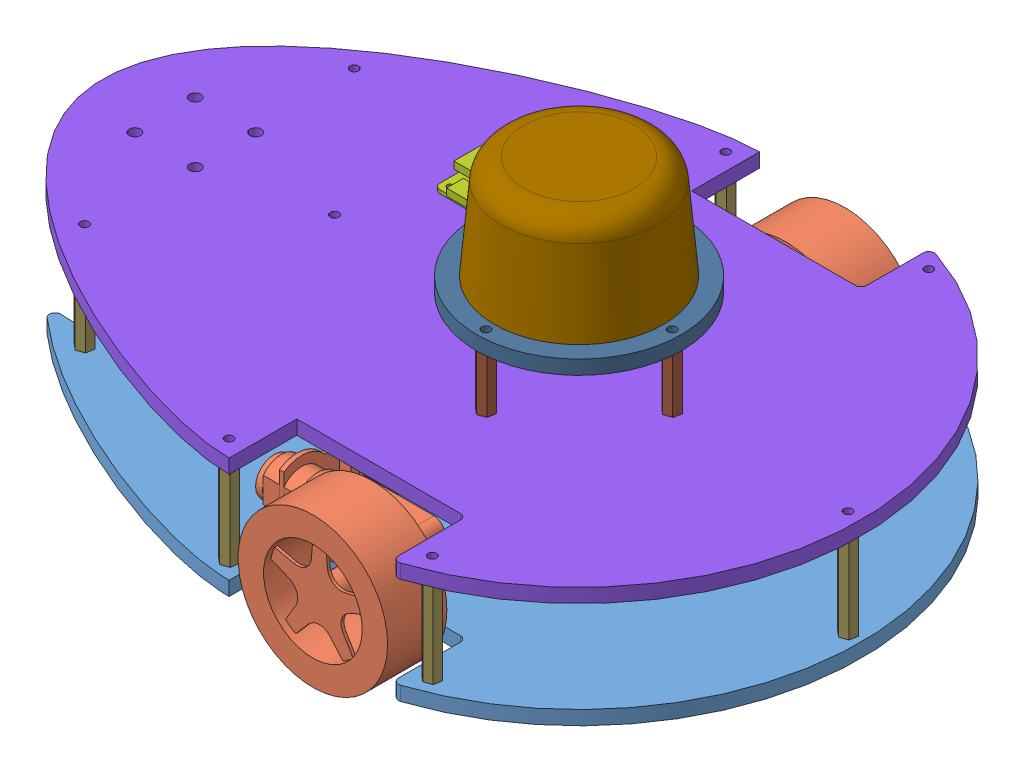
SolidWorks assembly robot assembly.SLDASM, configuration Default (file format 9000). Lengths in mm.
Overall size (416.56 149.8 241.6).
27 component instances, 13 part files, 49 mates.
Components (placement in the parent):
- lower chassis plate-1: lower chassis plate.SLDPRT [Default] at (73.1533 135.0562 185.2311) size (310.56 6.35 241.22)
- wheel and drive motor-1: wheel and drive motor.SLDPRT [Default] at (148.6894 152.5187 81.7252) x (0 0 -1) z (1 0 0) size (66.17 67.31 91.19)
- wheel and drive motor-2: wheel and drive motor.SLDPRT [Default] at (148.6894 152.5187 267.9072) x (0 0 1) z (1 0 0) size (66.17 67.31 91.19)
- caster wheel assembly-1: caster wheel assembly.SLDASM [Default] at (-34.1713 154.1876 146.7555) size (68.07 65.34 46.76)
  - caster wheel metal-1: caster wheel metal.SLDPRT [Default] at (10.1406 20.1116 28.0607) size (37.85 8.38 37.85)
  - caster wheel black-1: caster wheel black.SLDPRT [Default] at (27.9636 -12.2099 47.9757) x (0 -1 0) z (0.047283 0 -0.998882) size (38.35 59.06 38.73)
  - caster wheel wheelet-1: caster wheel wheelet.SLDPRT [Default] at (29.2727 -12.2099 20.3206) x (0.047283 0 -0.998882) z (0.998882 0 0.047283) size (13.61 49.28 49.28)
  - caster wheel wheelet-2: caster wheel wheelet.SLDPRT [Default] at (28.456 -12.2099 37.5733) x (-0.047283 0 0.998882) z (-0.998882 0 -0.047283) size (13.61 49.28 49.28)
- L298 motor controller-1: L298 motor controller.SLDPRT [Default] at (35.5823 141.4062 103.272) x (0 0 1) z (-1 0 0) size (44.2 26.54 44.2)
- raspberry pi zero w-1: raspberry pi zero w.SLDPRT [Default] at (52.4313 189.0312 143.7038) size (67.31 4.76 31.24)
- upper chassis plate2-1: upper chassis plate2.SLDPRT [Default] at (73.1533 182.6812 185.2311) size (416.56 6.35 241.22)
- rplidar-1: rplidar.SLDPRT [Default] at (149.9594 220.7812 176.0452) x (0.988399 0 0.15188) z (-0.15188 0 0.988399) size (76.2 46.35 76.2)
- rplidar mount-1: rplidar mount.SLDPRT [Default] at (149.9594 214.4312 176.0452) size (92.08 6.35 92.08)
- mcmaster 91115a133 6-32 standoff-1: mcmaster 91115a133 6-32 standoff.SLDPRT [Default] at (149.9594 214.4312 134.1352) x (1 0 0) z (0 -1 0) size (6.89 7.22 25.4)
- mcmaster 91115a133 6-32 standoff-2: mcmaster 91115a133 6-32 standoff.SLDPRT [Default] at (191.8694 214.4312 176.0452) x (0.999015 0 0.044379) z (0 -1 0) size (6.89 7.22 25.4)
- mcmaster 91115a133 6-32 standoff-3: mcmaster 91115a133 6-32 standoff.SLDPRT [Default] at (108.0494 214.4312 176.0452) x (1 0 0) z (0 -1 0) size (6.89 7.22 25.4)
- mcmaster 91115a133 6-32 standoff-4: mcmaster 91115a133 6-32 standoff.SLDPRT [Default] at (149.9594 214.4312 217.9552) x (1 0 0) z (0 -1 0) size (6.89 7.22 25.4)
- mcmaster 91115a564 6-32 standoff-1: mcmaster 91115a564 6-32 standoff.SLDPRT [Default] at (-13.1386 182.6812 114.1102) x (1 0 0) z (0 -1 0) size (6.89 7.22 41.27)
- mcmaster 91115a564 6-32 standoff-2: mcmaster 91115a564 6-32 standoff.SLDPRT [Default] at (-13.1386 182.6812 235.5222) x (1 0 0) z (0 -1 0) size (6.89 7.22 41.27)
- mcmaster 91115a564 6-32 standoff-3: mcmaster 91115a564 6-32 standoff.SLDPRT [Default] at (39.4694 182.6812 175.5782) x (1 0 0) z (0 -1 0) size (6.89 7.22 41.27)
- mcmaster 91115a564 6-32 standoff-4: mcmaster 91115a564 6-32 standoff.SLDPRT [Default] at (102.9694 182.6812 63.0562) x (1 0 0) z (0 -1 0) size (6.89 7.22 41.27)
- mcmaster 91115a564 6-32 standoff-5: mcmaster 91115a564 6-32 standoff.SLDPRT [Default] at (102.9694 182.6812 286.5762) x (1 0 0) z (0 -1 0) size (6.89 7.22 41.27)
- mcmaster 91115a564 6-32 standoff-6: mcmaster 91115a564 6-32 standoff.SLDPRT [Default] at (194.4094 182.6812 286.5762) x (1 0 0) z (0 -1 0) size (6.89 7.22 41.27)
- mcmaster 91115a564 6-32 standoff-7: mcmaster 91115a564 6-32 standoff.SLDPRT [Default] at (270.6094 182.6812 175.5782) x (1 0 0) z (0 -1 0) size (6.89 7.22 41.27)
- mcmaster 91115a564 6-32 standoff-8: mcmaster 91115a564 6-32 standoff.SLDPRT [Default] at (194.4094 182.6812 63.0562) x (1 0 0) z (0 -1 0) size (6.89 7.22 41.27)
- motor mount-1: motor mount.SLDPRT [Default] at (133.0684 164.0122 109.0302) x (-1 0 0) z (0 0 1) size (12.7 22.86 4.57)
- motor mount-2: motor mount.SLDPRT [Default] at (133.0684 164.0122 245.1742) x (-1 0 0) z (0 0 1) size (12.7 22.86 4.57)
Mates (geometry in assembly coordinates):
- Coincident2: coincident anti-aligned: plane of lower chassis plate-1 through (-65.6231 141.4062 174.8162) normal (0 1 0); plane of wheel and drive motor-1 through (153.7694 141.4062 104.4582) normal (0 -1 0)
- Coincident3: coincident aligned: plane of lower chassis plate-1 through (110.5894 141.4062 263.7162) normal (0 0 1); plane of wheel and drive motor-2 through (153.7694 158.5512 263.7162) normal (0 0 1)
- Coincident5: coincident anti-aligned: plane of lower chassis plate-1 through (-65.6231 141.4062 174.8162) normal (0 1 0); plane of wheel and drive motor-2 through (153.7694 141.4062 245.1742) normal (0 -1 0)
- Coincident11: coincident anti-aligned: plane of lower chassis plate-1 through (-65.6231 141.4062 174.8162) normal (0 1 0); plane of L298 motor controller-1 through (35.5823 141.4062 103.272) normal (0 -1 0)
- Distance2: distance = 27.94 mm anti-aligned: plane of wheel and drive motor-1 through (158.8494 158.5512 104.4582) normal (1 0 0); plane of lower chassis plate-1 through (186.7894 141.4062 57.9762) normal (-1 0 0)
- Distance3: distance = 27.94 mm anti-aligned: plane of wheel and drive motor-2 through (158.8494 146.4862 245.1742) normal (1 0 0); plane of lower chassis plate-1 through (186.7894 141.4062 266.2562) normal (-1 0 0)
- Coincident16: coincident aligned: plane of lower chassis plate-1 through (110.5894 141.4062 85.9162) normal (0 0 -1); plane of wheel and drive motor-1 through (153.7694 146.4862 85.9162) normal (0 0 -1)
- Coincident25: coincident aligned: plane of lower chassis plate-1 through (110.5894 141.4062 263.7162) normal (0 0 1); plane of upper chassis plate2-1 through (110.5894 189.0312 263.7162) normal (0 0 1)
- Coincident26: coincident aligned: plane of lower chassis plate-1 through (186.7894 141.4062 266.2562) normal (-1 0 0); plane of upper chassis plate2-1 through (186.7894 189.0312 266.2562) normal (-1 0 0)
- Concentric5: concentric anti-aligned: cylinder of upper chassis plate2-1 through (149.9594 189.0312 176.0452) axis (0 -1 0) radius 127; circle of rplidar-1
- Coincident29: coincident anti-aligned: plane of rplidar-1 through (149.9594 220.7812 176.0452) normal (0 -1 0); plane of rplidar mount-1 through (149.9594 220.7812 176.0452) normal (0 1 0)
- Concentric6: concentric anti-aligned: circle of rplidar-1; cylinder of rplidar mount-1 through (149.9594 220.7812 176.0452) axis (0 -1 0) radius 46.0375
- Coincident31: coincident anti-aligned: plane of raspberry pi zero w-1 through (54.9713 189.0312 141.1638) normal (0 -1 0); plane of upper chassis plate2-1 through (-65.6231 189.0312 174.8162) normal (0 1 0)
- Coincident32: coincident anti-aligned: plane of upper chassis plate2-1 through (-65.6231 189.0312 174.8162) normal (0 1 0); plane of mcmaster 91115a133 6-32 standoff-4 through (149.9594 189.0312 217.9552) normal (0 -1 0)
- Coincident33: coincident anti-aligned: plane of upper chassis plate2-1 through (-65.6231 189.0312 174.8162) normal (0 1 0); plane of mcmaster 91115a133 6-32 standoff-2 through (191.8694 189.0312 176.0452) normal (0 -1 0)
- Coincident34: coincident anti-aligned: plane of upper chassis plate2-1 through (-65.6231 189.0312 174.8162) normal (0 1 0); plane of mcmaster 91115a133 6-32 standoff-3 through (108.0494 189.0312 176.0452) normal (0 -1 0)
- Coincident35: coincident anti-aligned: plane of upper chassis plate2-1 through (-65.6231 189.0312 174.8162) normal (0 1 0); plane of mcmaster 91115a133 6-32 standoff-1 through (149.9594 189.0312 134.1352) normal (0 -1 0)
- Concentric7: concentric aligned: cylinder of upper chassis plate2-1 through (149.9594 189.0312 217.9552) axis (0 -1 0) radius 1.905; cylinder of mcmaster 91115a133 6-32 standoff-4 through (149.9594 214.4312 217.9552) axis (0 -1 0) radius 1.7242
- Concentric8: concentric aligned: cylinder of upper chassis plate2-1 through (108.0494 189.0312 176.0452) axis (0 -1 0) radius 1.905; cylinder of mcmaster 91115a133 6-32 standoff-3 through (108.0494 214.4312 176.0452) axis (0 -1 0) radius 1.7242
- Concentric9: concentric aligned: cylinder of upper chassis plate2-1 through (191.8694 189.0312 176.0452) axis (0 -1 0) radius 1.905; cylinder of mcmaster 91115a133 6-32 standoff-2 through (191.8694 214.4312 176.0452) axis (0 -1 0) radius 1.7242
- Concentric10: concentric aligned: cylinder of upper chassis plate2-1 through (149.9594 189.0312 134.1352) axis (0 -1 0) radius 1.905; cylinder of mcmaster 91115a133 6-32 standoff-1 through (149.9594 214.4312 134.1352) axis (0 -1 0) radius 1.7242
- Concentric11: concentric aligned: cylinder of rplidar mount-1 through (191.8694 220.7812 176.0452) axis (0 -1 0) radius 1.905; cylinder of mcmaster 91115a133 6-32 standoff-2 through (191.8694 214.4312 176.0452) axis (0 -1 0) radius 1.7242
- Coincident36: coincident anti-aligned: plane of rplidar mount-1 through (149.9594 214.4312 176.0452) normal (0 -1 0); plane of mcmaster 91115a133 6-32 standoff-2 through (191.8694 214.4312 176.0452) normal (0 1 0)
- Coincident37: coincident aligned: plane of mcmaster 91115a564 6-32 standoff-7 through (270.6094 141.4062 175.5782) normal (0 -1 0); plane of mcmaster 91115a564 6-32 standoff-8 through (194.4094 141.4062 63.0562) normal (0 -1 0)
- Coincident38: coincident aligned: plane of mcmaster 91115a564 6-32 standoff-6 through (194.4094 141.4062 286.5762) normal (0 -1 0); plane of mcmaster 91115a564 6-32 standoff-5 through (102.9694 141.4062 286.5762) normal (0 -1 0)
- Coincident39: coincident aligned: plane of mcmaster 91115a564 6-32 standoff-6 through (194.4094 141.4062 286.5762) normal (0 -1 0); plane of mcmaster 91115a564 6-32 standoff-7 through (270.6094 141.4062 175.5782) normal (0 -1 0)
- Coincident40: coincident aligned: plane of mcmaster 91115a564 6-32 standoff-4 through (102.9694 141.4062 63.0562) normal (0 -1 0); plane of mcmaster 91115a564 6-32 standoff-5 through (102.9694 141.4062 286.5762) normal (0 -1 0)
- Coincident41: coincident aligned: plane of mcmaster 91115a564 6-32 standoff-3 through (39.4694 141.4062 175.5782) normal (0 -1 0); plane of mcmaster 91115a564 6-32 standoff-4 through (102.9694 141.4062 63.0562) normal (0 -1 0)
- Coincident42: coincident aligned: plane of mcmaster 91115a564 6-32 standoff-2 through (-13.1386 141.4062 235.5222) normal (0 -1 0); plane of mcmaster 91115a564 6-32 standoff-3 through (39.4694 141.4062 175.5782) normal (0 -1 0)
- Coincident43: coincident aligned: plane of mcmaster 91115a564 6-32 standoff-1 through (-13.1386 141.4062 114.1102) normal (0 -1 0); plane of mcmaster 91115a564 6-32 standoff-2 through (-13.1386 141.4062 235.5222) normal (0 -1 0)
- Coincident44: coincident anti-aligned: plane of lower chassis plate-1 through (-65.6231 141.4062 174.8162) normal (0 1 0); plane of mcmaster 91115a564 6-32 standoff-1 through (-13.1386 141.4062 114.1102) normal (0 -1 0)
- Concentric12: concentric anti-aligned: cylinder of lower chassis plate-1 through (-13.1386 135.0562 114.1102) axis (0 1 0) radius 1.905; cylinder of mcmaster 91115a564 6-32 standoff-1 through (-13.1386 182.6812 114.1102) axis (0 -1 0) radius 1.7242
- Concentric13: concentric anti-aligned: cylinder of lower chassis plate-1 through (-13.1386 135.0562 235.5222) axis (0 1 0) radius 1.905; cylinder of mcmaster 91115a564 6-32 standoff-2 through (-13.1386 182.6812 235.5222) axis (0 -1 0) radius 1.7242
- Concentric14: concentric anti-aligned: cylinder of upper chassis plate2-1 through (39.4694 182.6812 175.5782) axis (0 1 0) radius 1.905; cylinder of mcmaster 91115a564 6-32 standoff-3 through (39.4694 182.6812 175.5782) axis (0 -1 0) radius 1.7242
- Concentric15: concentric anti-aligned: cylinder of upper chassis plate2-1 through (102.9694 182.6812 63.0562) axis (0 1 0) radius 1.905; cylinder of mcmaster 91115a564 6-32 standoff-4 through (102.9694 182.6812 63.0562) axis (0 -1 0) radius 1.7242
- Concentric16: concentric anti-aligned: cylinder of upper chassis plate2-1 through (194.4094 182.6812 63.0562) axis (0 1 0) radius 1.905; cylinder of mcmaster 91115a564 6-32 standoff-8 through (194.4094 182.6812 63.0562) axis (0 -1 0) radius 1.7242
- Concentric17: concentric anti-aligned: cylinder of upper chassis plate2-1 through (270.6094 182.6812 175.5782) axis (0 1 0) radius 1.905; cylinder of mcmaster 91115a564 6-32 standoff-7 through (270.6094 182.6812 175.5782) axis (0 -1 0) radius 1.7242
- Concentric18: concentric anti-aligned: cylinder of upper chassis plate2-1 through (194.4094 182.6812 286.5762) axis (0 1 0) radius 1.905; cylinder of mcmaster 91115a564 6-32 standoff-6 through (194.4094 182.6812 286.5762) axis (0 -1 0) radius 1.7242
- Concentric19: concentric anti-aligned: cylinder of upper chassis plate2-1 through (102.9694 182.6812 286.5762) axis (0 1 0) radius 1.905; cylinder of mcmaster 91115a564 6-32 standoff-5 through (102.9694 182.6812 286.5762) axis (0 -1 0) radius 1.7242
- Coincident45: coincident anti-aligned: plane of upper chassis plate2-1 through (-65.6231 182.6812 174.8162) normal (0 -1 0); plane of mcmaster 91115a564 6-32 standoff-5 through (102.9694 182.6812 286.5762) normal (0 1 0)
- Coincident46: coincident anti-aligned: plane of caster wheel assembly-1/caster wheel metal-1 through (-39.1436 182.6812 189.9292) normal (0 1 0); plane of upper chassis plate2-1 through (-65.6231 182.6812 174.8162) normal (0 -1 0)
- Concentric21: concentric aligned: cylinder of caster wheel assembly-1/caster wheel metal-1 through (-37.6196 182.6812 188.4052) axis (0 -1 0) radius 2.54; cylinder of upper chassis plate2-1 through (-37.6196 189.0312 188.4052) axis (0 -1 0) radius 2.54
- Concentric22: concentric aligned: cylinder of caster wheel assembly-1/caster wheel metal-1 through (-37.6196 182.6812 161.2272) axis (0 -1 0) radius 2.54; cylinder of upper chassis plate2-1 through (-37.6196 189.0312 161.2272) axis (0 -1 0) radius 2.54
- Concentric23: concentric anti-aligned: cylinder of wheel and drive motor-1 through (126.7184 143.6922 104.4582) axis (0 0 -1) radius 1.397; cylinder of motor mount-1 through (126.7184 143.6922 104.4582) axis (0 0 1) radius 1.524
- Coincident47: coincident anti-aligned: plane of wheel and drive motor-1 through (153.7694 146.4862 104.4582) normal (0 0 1); plane of motor mount-1 through (133.0684 141.1522 104.4582) normal (0 0 -1)
- Parallel6: parallel anti-aligned: plane of lower chassis plate-1 through (-65.6231 141.4062 174.8162) normal (0 1 0); plane of motor mount-1 through (133.0684 141.1522 109.0302) normal (0 -1 0)
- Concentric24: concentric aligned: cylinder of wheel and drive motor-2 through (126.7184 143.6922 245.1742) axis (0 0 1) radius 1.397; cylinder of motor mount-2 through (126.7184 143.6922 240.6022) axis (0 0 1) radius 1.524
- Coincident49: coincident anti-aligned: plane of wheel and drive motor-2 through (153.7694 158.5512 245.1742) normal (0 0 -1); plane of motor mount-2 through (133.0684 141.1522 245.1742) normal (0 0 1)
- Parallel7: parallel anti-aligned: plane of lower chassis plate-1 through (-65.6231 141.4062 174.8162) normal (0 1 0); plane of motor mount-2 through (133.0684 141.1522 245.1742) normal (0 -1 0)
